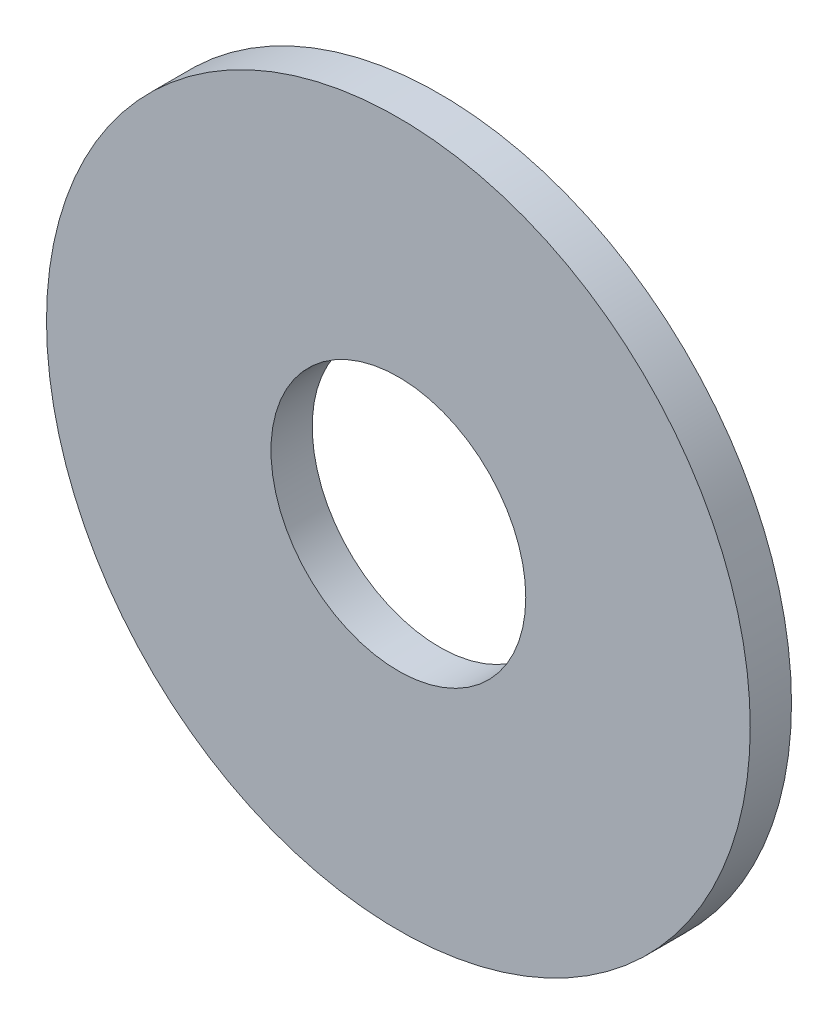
ISO-10303-21;
HEADER;
FILE_DESCRIPTION(('STEP AP214'),'2;1');
FILE_NAME('part.step','',(''),(''),'','','');
FILE_SCHEMA(('AUTOMOTIVE_DESIGN { 1 0 10303 214 1 1 1 1 }'));
ENDSEC;
DATA;
#1=APPLICATION_CONTEXT('core data for automotive mechanical design processes');
#2=APPLICATION_PROTOCOL_DEFINITION('international standard','automotive_design',2000,#1);
#3=PRODUCT_CONTEXT('',#1,'mechanical');
#4=PRODUCT('Part','Part','',(#3));
#5=PRODUCT_RELATED_PRODUCT_CATEGORY('part','',(#4));
#6=PRODUCT_DEFINITION_FORMATION('','',#4);
#7=PRODUCT_DEFINITION_CONTEXT('part definition',#1,'design');
#8=PRODUCT_DEFINITION('design','',#6,#7);
#9=PRODUCT_DEFINITION_SHAPE('','',#8);
#10=(LENGTH_UNIT() NAMED_UNIT(*) SI_UNIT(.MILLI.,.METRE.));
#11=(NAMED_UNIT(*) PLANE_ANGLE_UNIT() SI_UNIT($,.RADIAN.));
#12=(NAMED_UNIT(*) SI_UNIT($,.STERADIAN.) SOLID_ANGLE_UNIT());
#13=UNCERTAINTY_MEASURE_WITH_UNIT(LENGTH_MEASURE(1.E-05),#10,'distance_accuracy_value','');
#14=(GEOMETRIC_REPRESENTATION_CONTEXT(3) GLOBAL_UNCERTAINTY_ASSIGNED_CONTEXT((#13)) GLOBAL_UNIT_ASSIGNED_CONTEXT((#10,
#11,#12)) REPRESENTATION_CONTEXT('',''));
#15=CARTESIAN_POINT('',(0.,0.,0.));
#16=DIRECTION('',(0.,0.,1.));
#17=DIRECTION('',(1.,0.,0.));
#18=AXIS2_PLACEMENT_3D('',#15,#16,#17);
#19=CARTESIAN_POINT('',(0.,0.,1.7));
#20=DIRECTION('',(0.,0.,1.));
#21=DIRECTION('',(1.,0.,0.));
#22=AXIS2_PLACEMENT_3D('',#19,#20,#21);
#23=PLANE('',#22);
#24=CARTESIAN_POINT('',(0.,0.,1.7));
#25=DIRECTION('',(0.,0.,1.));
#26=DIRECTION('',(1.,0.,0.));
#27=AXIS2_PLACEMENT_3D('',#24,#25,#26);
#28=CIRCLE('',#27,14.5);
#29=CARTESIAN_POINT('',(14.5,0.,1.7));
#30=VERTEX_POINT('',#29);
#31=EDGE_CURVE('E10',#30,#30,#28,.T.);
#32=ORIENTED_EDGE('',*,*,#31,.T.);
#33=EDGE_LOOP('',(#32));
#34=FACE_BOUND('',#33,.T.);
#35=CARTESIAN_POINT('',(0.,0.,1.7));
#36=DIRECTION('',(0.,0.,1.));
#37=DIRECTION('',(1.,0.,0.));
#38=AXIS2_PLACEMENT_3D('',#35,#36,#37);
#39=CIRCLE('',#38,5.25);
#40=CARTESIAN_POINT('',(5.25,0.,1.7));
#41=VERTEX_POINT('',#40);
#42=EDGE_CURVE('E42',#41,#41,#39,.T.);
#43=ORIENTED_EDGE('',*,*,#42,.F.);
#44=EDGE_LOOP('',(#43));
#45=FACE_BOUND('',#44,.T.);
#46=ADVANCED_FACE('F31',(#34,#45),#23,.T.);
#47=CARTESIAN_POINT('',(0.,0.,0.));
#48=DIRECTION('',(0.,0.,1.));
#49=DIRECTION('',(1.,0.,0.));
#50=AXIS2_PLACEMENT_3D('',#47,#48,#49);
#51=PLANE('',#50);
#52=CARTESIAN_POINT('',(0.,0.,0.));
#53=DIRECTION('',(0.,0.,1.));
#54=DIRECTION('',(1.,0.,0.));
#55=AXIS2_PLACEMENT_3D('',#52,#53,#54);
#56=CIRCLE('',#55,14.5);
#57=CARTESIAN_POINT('',(14.5,0.,0.));
#58=VERTEX_POINT('',#57);
#59=EDGE_CURVE('E35',#58,#58,#56,.T.);
#60=ORIENTED_EDGE('',*,*,#59,.F.);
#61=EDGE_LOOP('',(#60));
#62=FACE_BOUND('',#61,.T.);
#63=CARTESIAN_POINT('',(0.,0.,0.));
#64=DIRECTION('',(0.,0.,1.));
#65=DIRECTION('',(1.,0.,0.));
#66=AXIS2_PLACEMENT_3D('',#63,#64,#65);
#67=CIRCLE('',#66,5.25);
#68=CARTESIAN_POINT('',(5.25,0.,0.));
#69=VERTEX_POINT('',#68);
#70=EDGE_CURVE('E44',#69,#69,#67,.T.);
#71=ORIENTED_EDGE('',*,*,#70,.T.);
#72=EDGE_LOOP('',(#71));
#73=FACE_BOUND('',#72,.T.);
#74=ADVANCED_FACE('F54',(#62,#73),#51,.F.);
#75=CARTESIAN_POINT('',(0.,0.,1.7));
#76=DIRECTION('',(0.,0.,-1.));
#77=DIRECTION('',(-1.,0.,0.));
#78=AXIS2_PLACEMENT_3D('',#75,#76,#77);
#79=CYLINDRICAL_SURFACE('',#78,14.5);
#80=ORIENTED_EDGE('',*,*,#31,.F.);
#81=EDGE_LOOP('',(#80));
#82=FACE_BOUND('',#81,.T.);
#83=ORIENTED_EDGE('',*,*,#59,.T.);
#84=EDGE_LOOP('',(#83));
#85=FACE_BOUND('',#84,.T.);
#86=ADVANCED_FACE('F33',(#82,#85),#79,.T.);
#87=CARTESIAN_POINT('',(0.,0.,1.7));
#88=DIRECTION('',(0.,0.,-1.));
#89=DIRECTION('',(-1.,0.,0.));
#90=AXIS2_PLACEMENT_3D('',#87,#88,#89);
#91=CYLINDRICAL_SURFACE('',#90,5.25);
#92=ORIENTED_EDGE('',*,*,#42,.T.);
#93=EDGE_LOOP('',(#92));
#94=FACE_BOUND('',#93,.T.);
#95=ORIENTED_EDGE('',*,*,#70,.F.);
#96=EDGE_LOOP('',(#95));
#97=FACE_BOUND('',#96,.T.);
#98=ADVANCED_FACE('F50',(#94,#97),#91,.F.);
#99=CLOSED_SHELL('',(#46,#74,#86,#98));
#100=MANIFOLD_SOLID_BREP('B2',#99);
#101=ADVANCED_BREP_SHAPE_REPRESENTATION('',(#18,#100),#14);
#102=SHAPE_DEFINITION_REPRESENTATION(#9,#101);
ENDSEC;
END-ISO-10303-21;
